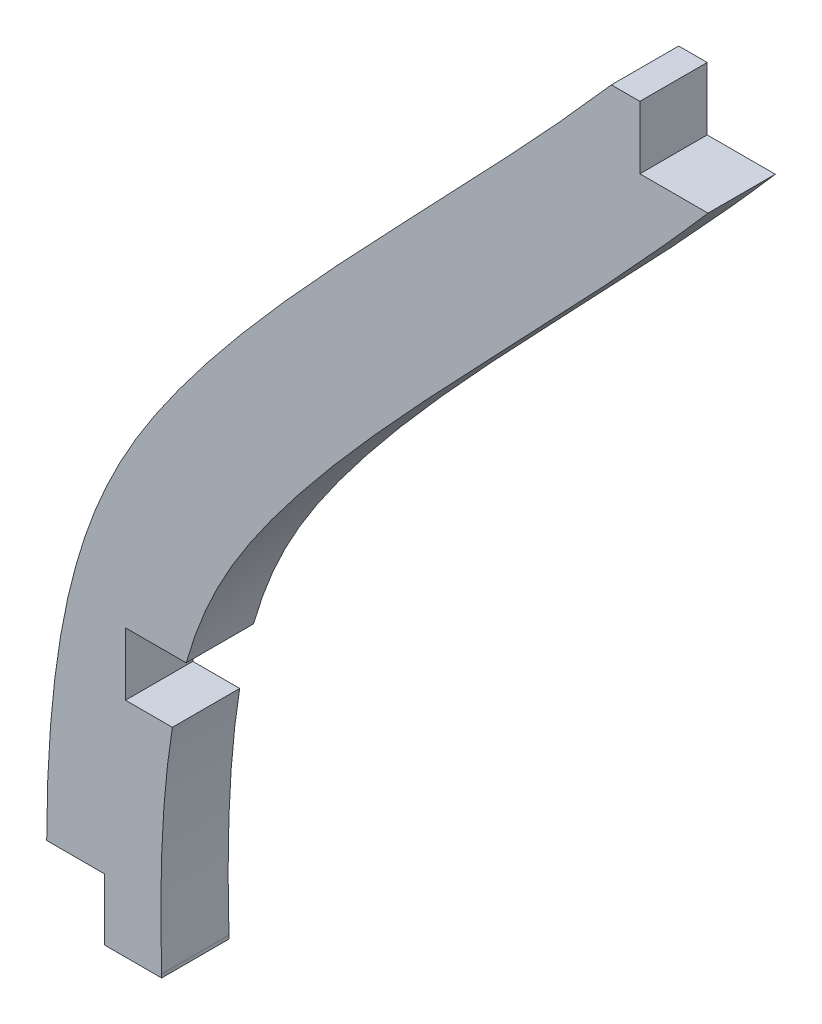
ISO-10303-21;
HEADER;
FILE_DESCRIPTION(('STEP AP214'),'2;1');
FILE_NAME('part.step','',(''),(''),'','','');
FILE_SCHEMA(('AUTOMOTIVE_DESIGN { 1 0 10303 214 1 1 1 1 }'));
ENDSEC;
DATA;
#1=APPLICATION_CONTEXT('core data for automotive mechanical design processes');
#2=APPLICATION_PROTOCOL_DEFINITION('international standard','automotive_design',2000,#1);
#3=PRODUCT_CONTEXT('',#1,'mechanical');
#4=PRODUCT('Part','Part','',(#3));
#5=PRODUCT_RELATED_PRODUCT_CATEGORY('part','',(#4));
#6=PRODUCT_DEFINITION_FORMATION('','',#4);
#7=PRODUCT_DEFINITION_CONTEXT('part definition',#1,'design');
#8=PRODUCT_DEFINITION('design','',#6,#7);
#9=PRODUCT_DEFINITION_SHAPE('','',#8);
#10=(LENGTH_UNIT() NAMED_UNIT(*) SI_UNIT(.MILLI.,.METRE.));
#11=(NAMED_UNIT(*) PLANE_ANGLE_UNIT() SI_UNIT($,.RADIAN.));
#12=(NAMED_UNIT(*) SI_UNIT($,.STERADIAN.) SOLID_ANGLE_UNIT());
#13=UNCERTAINTY_MEASURE_WITH_UNIT(LENGTH_MEASURE(1.E-05),#10,'distance_accuracy_value','');
#14=(GEOMETRIC_REPRESENTATION_CONTEXT(3) GLOBAL_UNCERTAINTY_ASSIGNED_CONTEXT((#13)) GLOBAL_UNIT_ASSIGNED_CONTEXT((#10,
#11,#12)) REPRESENTATION_CONTEXT('',''));
#15=CARTESIAN_POINT('',(0.,0.,0.));
#16=DIRECTION('',(0.,0.,1.));
#17=DIRECTION('',(1.,0.,0.));
#18=AXIS2_PLACEMENT_3D('',#15,#16,#17);
#19=CARTESIAN_POINT('',(-71.12228275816,0.152274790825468,2.9972));
#20=CARTESIAN_POINT('',(-71.1360709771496,0.612053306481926,2.9972));
#21=CARTESIAN_POINT('',(-71.1567058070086,1.54979316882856,2.9972));
#22=CARTESIAN_POINT('',(-71.1645984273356,3.28211812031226,2.9972));
#23=CARTESIAN_POINT('',(-71.1167972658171,5.2861742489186,2.9972));
#24=CARTESIAN_POINT('',(-70.9730711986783,7.42161548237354,2.9972));
#25=CARTESIAN_POINT('',(-70.6767068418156,9.95097976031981,2.9972));
#26=CARTESIAN_POINT('',(-70.1305550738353,12.5718264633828,2.9972));
#27=CARTESIAN_POINT('',(-69.2453812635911,15.104636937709,2.9972));
#28=CARTESIAN_POINT('',(-68.1202374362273,17.3343932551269,2.9972));
#29=CARTESIAN_POINT('',(-66.672184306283,19.5510756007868,2.9972));
#30=CARTESIAN_POINT('',(-64.8630643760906,21.9349302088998,2.9972));
#31=CARTESIAN_POINT('',(-62.1184326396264,25.2082421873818,2.9972));
#32=CARTESIAN_POINT('',(-58.1371910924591,29.5028468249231,2.9972));
#33=CARTESIAN_POINT('',(-52.8597313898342,34.9642275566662,2.9972));
#34=CARTESIAN_POINT('',(-47.4482093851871,40.7915416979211,2.9972));
#35=CARTESIAN_POINT('',(-42.2515146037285,47.0604507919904,2.9972));
#36=CARTESIAN_POINT('',(-37.6918324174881,53.925317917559,2.9972));
#37=CARTESIAN_POINT('',(-34.0642333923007,61.0843459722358,2.9972));
#38=CARTESIAN_POINT('',(-31.169794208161,68.4657942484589,2.9972));
#39=CARTESIAN_POINT('',(-28.9001236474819,75.9824768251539,2.9972));
#40=CARTESIAN_POINT('',(-27.1227122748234,83.5631378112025,2.9972));
#41=CARTESIAN_POINT('',(-25.7154204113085,91.1411224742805,2.9972));
#42=CARTESIAN_POINT('',(-24.7522109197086,97.3940158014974,2.9972));
#43=CARTESIAN_POINT('',(-24.0485885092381,102.335722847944,2.9972));
#44=CARTESIAN_POINT('',(-23.7122461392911,104.762949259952,2.9972));
#45=CARTESIAN_POINT('',(-23.5431598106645,105.98215738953,2.9972));
#46=B_SPLINE_CURVE_WITH_KNOTS('',3,(#19,#20,#21,#22,#23,#24,#25,#26,#27,#28,#29,#30,#31,#32,#33,
#34,#35,#36,#37,#38,#39,#40,#41,#42,#43,#44,#45),.UNSPECIFIED.,.F.,.F.,(4,1,1,1,1,1,1,1,1,1,1,1,
1,1,1,1,1,1,1,1,1,1,1,1,4),(0.,0.0078125,0.015625,0.03125,0.046875,0.0625,0.09375,0.125,0.15625,
0.1875,0.21875,0.25,0.3125,0.375,0.4375,0.5,0.5625,0.625,0.6875,0.75,0.8125,0.875,0.9375,
0.96875,1.),.UNSPECIFIED.);
#47=DIRECTION('',(0.,0.,-1.));
#48=VECTOR('',#47,1.);
#49=SURFACE_OF_LINEAR_EXTRUSION('',#46,#48);
#50=CARTESIAN_POINT('',(-71.12228275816,0.152274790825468,0.));
#51=CARTESIAN_POINT('',(-71.1360709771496,0.612053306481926,0.));
#52=CARTESIAN_POINT('',(-71.1567058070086,1.54979316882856,0.));
#53=CARTESIAN_POINT('',(-71.1645984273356,3.28211812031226,0.));
#54=CARTESIAN_POINT('',(-71.1167972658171,5.2861742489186,0.));
#55=CARTESIAN_POINT('',(-70.9730711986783,7.42161548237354,0.));
#56=CARTESIAN_POINT('',(-70.6767068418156,9.95097976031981,0.));
#57=CARTESIAN_POINT('',(-70.1305550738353,12.5718264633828,0.));
#58=CARTESIAN_POINT('',(-69.2453812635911,15.104636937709,0.));
#59=CARTESIAN_POINT('',(-68.1202374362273,17.3343932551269,0.));
#60=CARTESIAN_POINT('',(-66.672184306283,19.5510756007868,0.));
#61=CARTESIAN_POINT('',(-64.8630643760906,21.9349302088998,0.));
#62=CARTESIAN_POINT('',(-62.1184326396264,25.2082421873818,0.));
#63=CARTESIAN_POINT('',(-58.1371910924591,29.5028468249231,0.));
#64=CARTESIAN_POINT('',(-52.8597313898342,34.9642275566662,0.));
#65=CARTESIAN_POINT('',(-47.4482093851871,40.7915416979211,0.));
#66=CARTESIAN_POINT('',(-42.2515146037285,47.0604507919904,0.));
#67=CARTESIAN_POINT('',(-37.6918324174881,53.925317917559,0.));
#68=CARTESIAN_POINT('',(-34.0642333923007,61.0843459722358,0.));
#69=CARTESIAN_POINT('',(-31.169794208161,68.4657942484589,0.));
#70=CARTESIAN_POINT('',(-28.9001236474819,75.9824768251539,0.));
#71=CARTESIAN_POINT('',(-27.1227122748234,83.5631378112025,0.));
#72=CARTESIAN_POINT('',(-25.7154204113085,91.1411224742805,0.));
#73=CARTESIAN_POINT('',(-24.7522109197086,97.3940158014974,0.));
#74=CARTESIAN_POINT('',(-24.0485885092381,102.335722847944,0.));
#75=CARTESIAN_POINT('',(-23.7122461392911,104.762949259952,0.));
#76=CARTESIAN_POINT('',(-23.5431598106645,105.98215738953,0.));
#77=B_SPLINE_CURVE_WITH_KNOTS('',3,(#50,#51,#52,#53,#54,#55,#56,#57,#58,#59,#60,#61,#62,#63,#64,
#65,#66,#67,#68,#69,#70,#71,#72,#73,#74,#75,#76),.UNSPECIFIED.,.F.,.F.,(4,1,1,1,1,1,1,1,1,1,1,1,
1,1,1,1,1,1,1,1,1,1,1,1,4),(0.,0.0078125,0.015625,0.03125,0.046875,0.0625,0.09375,0.125,0.15625,
0.1875,0.21875,0.25,0.3125,0.375,0.4375,0.5,0.5625,0.625,0.6875,0.75,0.8125,0.875,0.9375,
0.96875,1.),.UNSPECIFIED.);
#78=CARTESIAN_POINT('',(-70.0284766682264,12.7,0.));
#79=VERTEX_POINT('',#78);
#80=CARTESIAN_POINT('',(-46.7957446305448,41.656,0.));
#81=VERTEX_POINT('',#80);
#82=EDGE_CURVE('E157',#79,#81,#77,.T.);
#83=ORIENTED_EDGE('',*,*,#82,.T.);
#84=DIRECTION('',(0.,0.,-1.));
#85=VECTOR('',#84,1.);
#86=CARTESIAN_POINT('',(-46.7957446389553,41.656,2.9972));
#87=LINE('',#86,#85);
#88=CARTESIAN_POINT('',(-46.7957446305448,41.656,2.9972));
#89=VERTEX_POINT('',#88);
#90=EDGE_CURVE('E241',#81,#89,#87,.F.);
#91=ORIENTED_EDGE('',*,*,#90,.T.);
#92=CARTESIAN_POINT('',(-70.0284766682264,12.7,2.9972));
#93=VERTEX_POINT('',#92);
#94=EDGE_CURVE('E170',#93,#89,#46,.T.);
#95=ORIENTED_EDGE('',*,*,#94,.F.);
#96=DIRECTION('',(0.,0.,1.));
#97=VECTOR('',#96,1.);
#98=CARTESIAN_POINT('',(-70.0284766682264,12.7,0.));
#99=LINE('',#98,#97);
#100=EDGE_CURVE('E226',#79,#93,#99,.T.);
#101=ORIENTED_EDGE('',*,*,#100,.F.);
#102=EDGE_LOOP('',(#83,#91,#95,#101));
#103=FACE_BOUND('',#102,.T.);
#104=ADVANCED_FACE('F33',(#103),#49,.F.);
#105=CARTESIAN_POINT('',(-71.12228275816,0.152274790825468,0.));
#106=VERTEX_POINT('',#105);
#107=CARTESIAN_POINT('',(-70.6430311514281,9.90599999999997,0.));
#108=VERTEX_POINT('',#107);
#109=EDGE_CURVE('E153',#106,#108,#77,.T.);
#110=ORIENTED_EDGE('',*,*,#109,.T.);
#111=DIRECTION('',(0.,0.,1.));
#112=VECTOR('',#111,1.);
#113=CARTESIAN_POINT('',(-70.6430311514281,9.90599999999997,0.));
#114=LINE('',#113,#112);
#115=CARTESIAN_POINT('',(-70.6430311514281,9.90599999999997,2.9972));
#116=VERTEX_POINT('',#115);
#117=EDGE_CURVE('E212',#108,#116,#114,.T.);
#118=ORIENTED_EDGE('',*,*,#117,.T.);
#119=CARTESIAN_POINT('',(-71.12228275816,0.152274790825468,2.9972));
#120=VERTEX_POINT('',#119);
#121=EDGE_CURVE('E171',#120,#116,#46,.T.);
#122=ORIENTED_EDGE('',*,*,#121,.F.);
#123=DIRECTION('',(0.,0.,-1.));
#124=VECTOR('',#123,1.);
#125=CARTESIAN_POINT('',(-71.12228275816,0.152274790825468,2.9972));
#126=LINE('',#125,#124);
#127=EDGE_CURVE('E42',#120,#106,#126,.T.);
#128=ORIENTED_EDGE('',*,*,#127,.T.);
#129=EDGE_LOOP('',(#110,#118,#122,#128));
#130=FACE_BOUND('',#129,.T.);
#131=ADVANCED_FACE('F188',(#130),#49,.F.);
#132=CARTESIAN_POINT('',(-28.575,106.68,2.9972));
#133=CARTESIAN_POINT('',(-31.1223322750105,88.3122925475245,2.9972));
#134=CARTESIAN_POINT('',(-35.6949869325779,54.9592886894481,2.9972));
#135=CARTESIAN_POINT('',(-70.4253531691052,26.7634785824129,2.9972));
#136=CARTESIAN_POINT('',(-76.5696549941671,12.326423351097,2.9972));
#137=CARTESIAN_POINT('',(-76.2,0.,2.9972));
#138=B_SPLINE_CURVE_WITH_KNOTS('',3,(#132,#133,#134,#135,#136,#137),.UNSPECIFIED.,.F.,.F.,(4,1,
1,4),(0.,0.473853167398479,0.807071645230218,1.),.UNSPECIFIED.);
#139=DIRECTION('',(0.,0.,-1.));
#140=VECTOR('',#139,1.);
#141=SURFACE_OF_LINEAR_EXTRUSION('',#138,#140);
#142=CARTESIAN_POINT('',(-51.097631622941,44.45,2.9972));
#143=VERTEX_POINT('',#142);
#144=CARTESIAN_POINT('',(-76.239147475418,2.74319999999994,2.9972));
#145=VERTEX_POINT('',#144);
#146=EDGE_CURVE('E145',#143,#145,#138,.T.);
#147=ORIENTED_EDGE('',*,*,#146,.F.);
#148=DIRECTION('',(0.,0.,-1.));
#149=VECTOR('',#148,1.);
#150=CARTESIAN_POINT('',(-51.0976316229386,44.45,2.9972));
#151=LINE('',#150,#149);
#152=CARTESIAN_POINT('',(-51.097631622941,44.45,0.));
#153=VERTEX_POINT('',#152);
#154=EDGE_CURVE('E129',#143,#153,#151,.T.);
#155=ORIENTED_EDGE('',*,*,#154,.T.);
#156=CARTESIAN_POINT('',(-28.575,106.68,0.));
#157=CARTESIAN_POINT('',(-31.1223322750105,88.3122925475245,0.));
#158=CARTESIAN_POINT('',(-35.6949869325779,54.9592886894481,0.));
#159=CARTESIAN_POINT('',(-70.4253531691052,26.7634785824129,0.));
#160=CARTESIAN_POINT('',(-76.5696549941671,12.326423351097,0.));
#161=CARTESIAN_POINT('',(-76.2,0.,0.));
#162=B_SPLINE_CURVE_WITH_KNOTS('',3,(#156,#157,#158,#159,#160,#161),.UNSPECIFIED.,.F.,.F.,(4,1,
1,4),(0.,0.473853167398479,0.807071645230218,1.),.UNSPECIFIED.);
#163=CARTESIAN_POINT('',(-76.239147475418,2.74319999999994,0.));
#164=VERTEX_POINT('',#163);
#165=EDGE_CURVE('E177',#153,#164,#162,.T.);
#166=ORIENTED_EDGE('',*,*,#165,.T.);
#167=DIRECTION('',(0.,0.,1.));
#168=VECTOR('',#167,1.);
#169=CARTESIAN_POINT('',(-76.239147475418,2.74319999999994,0.));
#170=LINE('',#169,#168);
#171=EDGE_CURVE('E151',#164,#145,#170,.T.);
#172=ORIENTED_EDGE('',*,*,#171,.T.);
#173=EDGE_LOOP('',(#147,#155,#166,#172));
#174=FACE_BOUND('',#173,.T.);
#175=ADVANCED_FACE('F35',(#174),#141,.F.);
#176=CARTESIAN_POINT('',(-71.1222823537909,0.,2.9972));
#177=DIRECTION('',(0.,1.,0.));
#178=DIRECTION('',(-1.,0.,0.));
#179=AXIS2_PLACEMENT_3D('',#176,#177,#178);
#180=PLANE('',#179);
#181=DIRECTION('',(1.,0.,0.));
#182=VECTOR('',#181,1.);
#183=CARTESIAN_POINT('',(-71.1222823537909,0.,2.9972));
#184=LINE('',#183,#182);
#185=CARTESIAN_POINT('',(-73.66,0.,2.9972));
#186=VERTEX_POINT('',#185);
#187=CARTESIAN_POINT('',(-71.1222823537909,0.,2.9972));
#188=VERTEX_POINT('',#187);
#189=EDGE_CURVE('E152',#186,#188,#184,.T.);
#190=ORIENTED_EDGE('',*,*,#189,.F.);
#191=DIRECTION('',(0.,0.,1.));
#192=VECTOR('',#191,1.);
#193=CARTESIAN_POINT('',(-73.66,0.,0.));
#194=LINE('',#193,#192);
#195=CARTESIAN_POINT('',(-73.66,0.,0.));
#196=VERTEX_POINT('',#195);
#197=EDGE_CURVE('E163',#196,#186,#194,.T.);
#198=ORIENTED_EDGE('',*,*,#197,.F.);
#199=DIRECTION('',(1.,0.,0.));
#200=VECTOR('',#199,1.);
#201=CARTESIAN_POINT('',(-71.1222823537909,0.,0.));
#202=LINE('',#201,#200);
#203=CARTESIAN_POINT('',(-71.1222823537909,0.,0.));
#204=VERTEX_POINT('',#203);
#205=EDGE_CURVE('E274',#196,#204,#202,.T.);
#206=ORIENTED_EDGE('',*,*,#205,.T.);
#207=DIRECTION('',(0.,0.,-1.));
#208=VECTOR('',#207,1.);
#209=CARTESIAN_POINT('',(-71.1222823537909,0.,2.9972));
#210=LINE('',#209,#208);
#211=EDGE_CURVE('E11',#188,#204,#210,.T.);
#212=ORIENTED_EDGE('',*,*,#211,.F.);
#213=EDGE_LOOP('',(#190,#198,#206,#212));
#214=FACE_BOUND('',#213,.T.);
#215=ADVANCED_FACE('F194',(#214),#180,.F.);
#216=CARTESIAN_POINT('',(-71.12228275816,0.152274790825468,2.9972));
#217=DIRECTION('',(-0.999999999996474,-2.65552242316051E-06,0.));
#218=DIRECTION('',(2.65552242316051E-06,-0.999999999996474,0.));
#219=AXIS2_PLACEMENT_3D('',#216,#217,#218);
#220=PLANE('',#219);
#221=DIRECTION('',(-2.65552242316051E-06,0.999999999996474,0.));
#222=VECTOR('',#221,1.);
#223=CARTESIAN_POINT('',(-71.12228275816,0.152274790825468,0.));
#224=LINE('',#223,#222);
#225=EDGE_CURVE('E273',#204,#106,#224,.T.);
#226=ORIENTED_EDGE('',*,*,#225,.T.);
#227=ORIENTED_EDGE('',*,*,#127,.F.);
#228=DIRECTION('',(-2.65552242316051E-06,0.999999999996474,0.));
#229=VECTOR('',#228,1.);
#230=CARTESIAN_POINT('',(-71.12228275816,0.152274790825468,2.9972));
#231=LINE('',#230,#229);
#232=EDGE_CURVE('E154',#188,#120,#231,.T.);
#233=ORIENTED_EDGE('',*,*,#232,.F.);
#234=ORIENTED_EDGE('',*,*,#211,.T.);
#235=EDGE_LOOP('',(#226,#227,#233,#234));
#236=FACE_BOUND('',#235,.T.);
#237=ADVANCED_FACE('F192',(#236),#220,.F.);
#238=CARTESIAN_POINT('',(-46.430466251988,50.1960313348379,2.9972));
#239=DIRECTION('',(0.,0.,1.));
#240=DIRECTION('',(1.,0.,0.));
#241=AXIS2_PLACEMENT_3D('',#238,#239,#240);
#242=PLANE('',#241);
#243=DIRECTION('',(1.,0.,0.));
#244=VECTOR('',#243,1.);
#245=CARTESIAN_POINT('',(-52.1715847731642,44.45,2.9972));
#246=LINE('',#245,#244);
#247=CARTESIAN_POINT('',(-49.8276316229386,44.45,2.9972));
#248=VERTEX_POINT('',#247);
#249=EDGE_CURVE('E132',#143,#248,#246,.T.);
#250=ORIENTED_EDGE('',*,*,#249,.F.);
#251=ORIENTED_EDGE('',*,*,#146,.T.);
#252=DIRECTION('',(-1.,0.,0.));
#253=VECTOR('',#252,1.);
#254=CARTESIAN_POINT('',(-73.66,2.7432,2.9972));
#255=LINE('',#254,#253);
#256=CARTESIAN_POINT('',(-73.66,2.7432,2.9972));
#257=VERTEX_POINT('',#256);
#258=EDGE_CURVE('E210',#257,#145,#255,.T.);
#259=ORIENTED_EDGE('',*,*,#258,.F.);
#260=DIRECTION('',(0.,1.,0.));
#261=VECTOR('',#260,1.);
#262=CARTESIAN_POINT('',(-73.66,0.,2.9972));
#263=LINE('',#262,#261);
#264=EDGE_CURVE('E209',#186,#257,#263,.T.);
#265=ORIENTED_EDGE('',*,*,#264,.F.);
#266=ORIENTED_EDGE('',*,*,#189,.T.);
#267=ORIENTED_EDGE('',*,*,#232,.T.);
#268=ORIENTED_EDGE('',*,*,#121,.T.);
#269=DIRECTION('',(1.,0.,0.));
#270=VECTOR('',#269,1.);
#271=CARTESIAN_POINT('',(-72.7299662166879,9.906,2.9972));
#272=LINE('',#271,#270);
#273=CARTESIAN_POINT('',(-72.7299662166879,9.906,2.9972));
#274=VERTEX_POINT('',#273);
#275=EDGE_CURVE('E232',#274,#116,#272,.T.);
#276=ORIENTED_EDGE('',*,*,#275,.F.);
#277=DIRECTION('',(0.,-1.,0.));
#278=VECTOR('',#277,1.);
#279=CARTESIAN_POINT('',(-72.7299662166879,12.7,2.9972));
#280=LINE('',#279,#278);
#281=CARTESIAN_POINT('',(-72.7299662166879,12.7,2.9972));
#282=VERTEX_POINT('',#281);
#283=EDGE_CURVE('E235',#282,#274,#280,.T.);
#284=ORIENTED_EDGE('',*,*,#283,.F.);
#285=DIRECTION('',(-1.,0.,0.));
#286=VECTOR('',#285,1.);
#287=CARTESIAN_POINT('',(-70.0284766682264,12.7,2.9972));
#288=LINE('',#287,#286);
#289=EDGE_CURVE('E238',#93,#282,#288,.T.);
#290=ORIENTED_EDGE('',*,*,#289,.F.);
#291=ORIENTED_EDGE('',*,*,#94,.T.);
#292=DIRECTION('',(1.,0.,0.));
#293=VECTOR('',#292,1.);
#294=CARTESIAN_POINT('',(-44.459383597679,41.656,2.9972));
#295=LINE('',#294,#293);
#296=CARTESIAN_POINT('',(-49.8276316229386,41.656,2.9972));
#297=VERTEX_POINT('',#296);
#298=EDGE_CURVE('E254',#297,#89,#295,.T.);
#299=ORIENTED_EDGE('',*,*,#298,.F.);
#300=DIRECTION('',(0.,-1.,0.));
#301=VECTOR('',#300,1.);
#302=CARTESIAN_POINT('',(-49.8276316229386,41.656,2.9972));
#303=LINE('',#302,#301);
#304=EDGE_CURVE('E139',#248,#297,#303,.T.);
#305=ORIENTED_EDGE('',*,*,#304,.F.);
#306=EDGE_LOOP('',(#250,#251,#259,#265,#266,#267,#268,#276,#284,#290,#291,#299,#305));
#307=FACE_BOUND('',#306,.T.);
#308=ADVANCED_FACE('F143',(#307),#242,.T.);
#309=CARTESIAN_POINT('',(-46.430466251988,50.1960313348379,0.));
#310=DIRECTION('',(0.,0.,1.));
#311=DIRECTION('',(1.,0.,0.));
#312=AXIS2_PLACEMENT_3D('',#309,#310,#311);
#313=PLANE('',#312);
#314=ORIENTED_EDGE('',*,*,#165,.F.);
#315=DIRECTION('',(1.,0.,0.));
#316=VECTOR('',#315,1.);
#317=CARTESIAN_POINT('',(-46.430466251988,44.45,0.));
#318=LINE('',#317,#316);
#319=CARTESIAN_POINT('',(-49.8276316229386,44.45,0.));
#320=VERTEX_POINT('',#319);
#321=EDGE_CURVE('E135',#153,#320,#318,.T.);
#322=ORIENTED_EDGE('',*,*,#321,.T.);
#323=DIRECTION('',(0.,-1.,0.));
#324=VECTOR('',#323,1.);
#325=CARTESIAN_POINT('',(-49.8276316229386,41.656,0.));
#326=LINE('',#325,#324);
#327=CARTESIAN_POINT('',(-49.8276316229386,41.656,0.));
#328=VERTEX_POINT('',#327);
#329=EDGE_CURVE('E256',#320,#328,#326,.T.);
#330=ORIENTED_EDGE('',*,*,#329,.T.);
#331=DIRECTION('',(1.,0.,0.));
#332=VECTOR('',#331,1.);
#333=CARTESIAN_POINT('',(-44.459383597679,41.656,0.));
#334=LINE('',#333,#332);
#335=EDGE_CURVE('E252',#328,#81,#334,.T.);
#336=ORIENTED_EDGE('',*,*,#335,.T.);
#337=ORIENTED_EDGE('',*,*,#82,.F.);
#338=DIRECTION('',(-1.,0.,0.));
#339=VECTOR('',#338,1.);
#340=CARTESIAN_POINT('',(-70.0284766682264,12.7,0.));
#341=LINE('',#340,#339);
#342=CARTESIAN_POINT('',(-72.7299662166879,12.7,0.));
#343=VERTEX_POINT('',#342);
#344=EDGE_CURVE('E234',#79,#343,#341,.T.);
#345=ORIENTED_EDGE('',*,*,#344,.T.);
#346=DIRECTION('',(0.,-1.,0.));
#347=VECTOR('',#346,1.);
#348=CARTESIAN_POINT('',(-72.7299662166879,12.7,0.));
#349=LINE('',#348,#347);
#350=CARTESIAN_POINT('',(-72.7299662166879,9.906,0.));
#351=VERTEX_POINT('',#350);
#352=EDGE_CURVE('E49',#343,#351,#349,.T.);
#353=ORIENTED_EDGE('',*,*,#352,.T.);
#354=DIRECTION('',(1.,0.,0.));
#355=VECTOR('',#354,1.);
#356=CARTESIAN_POINT('',(-72.7299662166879,9.906,0.));
#357=LINE('',#356,#355);
#358=EDGE_CURVE('E229',#351,#108,#357,.T.);
#359=ORIENTED_EDGE('',*,*,#358,.T.);
#360=ORIENTED_EDGE('',*,*,#109,.F.);
#361=ORIENTED_EDGE('',*,*,#225,.F.);
#362=ORIENTED_EDGE('',*,*,#205,.F.);
#363=DIRECTION('',(0.,1.,0.));
#364=VECTOR('',#363,1.);
#365=CARTESIAN_POINT('',(-73.66,0.,0.));
#366=LINE('',#365,#364);
#367=CARTESIAN_POINT('',(-73.66,2.7432,0.));
#368=VERTEX_POINT('',#367);
#369=EDGE_CURVE('E214',#196,#368,#366,.T.);
#370=ORIENTED_EDGE('',*,*,#369,.T.);
#371=DIRECTION('',(-1.,0.,0.));
#372=VECTOR('',#371,1.);
#373=CARTESIAN_POINT('',(-73.66,2.7432,0.));
#374=LINE('',#373,#372);
#375=EDGE_CURVE('E57',#368,#164,#374,.T.);
#376=ORIENTED_EDGE('',*,*,#375,.T.);
#377=EDGE_LOOP('',(#314,#322,#330,#336,#337,#345,#353,#359,#360,#361,#362,#370,#376));
#378=FACE_BOUND('',#377,.T.);
#379=ADVANCED_FACE('F190',(#378),#313,.F.);
#380=CARTESIAN_POINT('',(-73.66,2.7432,0.));
#381=DIRECTION('',(0.,1.,0.));
#382=DIRECTION('',(-1.,0.,0.));
#383=AXIS2_PLACEMENT_3D('',#380,#381,#382);
#384=PLANE('',#383);
#385=ORIENTED_EDGE('',*,*,#258,.T.);
#386=ORIENTED_EDGE('',*,*,#171,.F.);
#387=ORIENTED_EDGE('',*,*,#375,.F.);
#388=DIRECTION('',(0.,0.,1.));
#389=VECTOR('',#388,1.);
#390=CARTESIAN_POINT('',(-73.66,2.7432,0.));
#391=LINE('',#390,#389);
#392=EDGE_CURVE('E222',#368,#257,#391,.T.);
#393=ORIENTED_EDGE('',*,*,#392,.T.);
#394=EDGE_LOOP('',(#385,#386,#387,#393));
#395=FACE_BOUND('',#394,.T.);
#396=ADVANCED_FACE('F305',(#395),#384,.F.);
#397=CARTESIAN_POINT('',(-73.66,0.,0.));
#398=DIRECTION('',(1.,0.,0.));
#399=DIRECTION('',(0.,0.,-1.));
#400=AXIS2_PLACEMENT_3D('',#397,#398,#399);
#401=PLANE('',#400);
#402=ORIENTED_EDGE('',*,*,#264,.T.);
#403=ORIENTED_EDGE('',*,*,#392,.F.);
#404=ORIENTED_EDGE('',*,*,#369,.F.);
#405=ORIENTED_EDGE('',*,*,#197,.T.);
#406=EDGE_LOOP('',(#402,#403,#404,#405));
#407=FACE_BOUND('',#406,.T.);
#408=ADVANCED_FACE('F308',(#407),#401,.F.);
#409=CARTESIAN_POINT('',(-72.7299662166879,9.906,0.));
#410=DIRECTION('',(0.,-1.,0.));
#411=DIRECTION('',(1.,0.,0.));
#412=AXIS2_PLACEMENT_3D('',#409,#410,#411);
#413=PLANE('',#412);
#414=ORIENTED_EDGE('',*,*,#275,.T.);
#415=ORIENTED_EDGE('',*,*,#117,.F.);
#416=ORIENTED_EDGE('',*,*,#358,.F.);
#417=DIRECTION('',(0.,0.,1.));
#418=VECTOR('',#417,1.);
#419=CARTESIAN_POINT('',(-72.7299662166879,9.906,0.));
#420=LINE('',#419,#418);
#421=EDGE_CURVE('E217',#351,#274,#420,.T.);
#422=ORIENTED_EDGE('',*,*,#421,.T.);
#423=EDGE_LOOP('',(#414,#415,#416,#422));
#424=FACE_BOUND('',#423,.T.);
#425=ADVANCED_FACE('F288',(#424),#413,.F.);
#426=CARTESIAN_POINT('',(-72.7299662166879,12.7,0.));
#427=DIRECTION('',(-1.,0.,0.));
#428=DIRECTION('',(0.,0.,1.));
#429=AXIS2_PLACEMENT_3D('',#426,#427,#428);
#430=PLANE('',#429);
#431=ORIENTED_EDGE('',*,*,#283,.T.);
#432=ORIENTED_EDGE('',*,*,#421,.F.);
#433=ORIENTED_EDGE('',*,*,#352,.F.);
#434=DIRECTION('',(0.,0.,1.));
#435=VECTOR('',#434,1.);
#436=CARTESIAN_POINT('',(-72.7299662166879,12.7,0.));
#437=LINE('',#436,#435);
#438=EDGE_CURVE('E228',#343,#282,#437,.T.);
#439=ORIENTED_EDGE('',*,*,#438,.T.);
#440=EDGE_LOOP('',(#431,#432,#433,#439));
#441=FACE_BOUND('',#440,.T.);
#442=ADVANCED_FACE('F292',(#441),#430,.F.);
#443=CARTESIAN_POINT('',(-70.0284766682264,12.7,0.));
#444=DIRECTION('',(0.,1.,0.));
#445=DIRECTION('',(0.,0.,1.));
#446=AXIS2_PLACEMENT_3D('',#443,#444,#445);
#447=PLANE('',#446);
#448=ORIENTED_EDGE('',*,*,#289,.T.);
#449=ORIENTED_EDGE('',*,*,#438,.F.);
#450=ORIENTED_EDGE('',*,*,#344,.F.);
#451=ORIENTED_EDGE('',*,*,#100,.T.);
#452=EDGE_LOOP('',(#448,#449,#450,#451));
#453=FACE_BOUND('',#452,.T.);
#454=ADVANCED_FACE('F294',(#453),#447,.F.);
#455=CARTESIAN_POINT('',(-44.459383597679,41.656,0.));
#456=DIRECTION('',(0.,-1.,0.));
#457=DIRECTION('',(0.,0.,-1.));
#458=AXIS2_PLACEMENT_3D('',#455,#456,#457);
#459=PLANE('',#458);
#460=ORIENTED_EDGE('',*,*,#335,.F.);
#461=DIRECTION('',(0.,0.,1.));
#462=VECTOR('',#461,1.);
#463=CARTESIAN_POINT('',(-49.8276316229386,41.656,0.));
#464=LINE('',#463,#462);
#465=EDGE_CURVE('E249',#328,#297,#464,.T.);
#466=ORIENTED_EDGE('',*,*,#465,.T.);
#467=ORIENTED_EDGE('',*,*,#298,.T.);
#468=ORIENTED_EDGE('',*,*,#90,.F.);
#469=EDGE_LOOP('',(#460,#466,#467,#468));
#470=FACE_BOUND('',#469,.T.);
#471=ADVANCED_FACE('F267',(#470),#459,.F.);
#472=CARTESIAN_POINT('',(-49.8276316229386,41.656,0.));
#473=DIRECTION('',(-1.,0.,0.));
#474=DIRECTION('',(0.,0.,1.));
#475=AXIS2_PLACEMENT_3D('',#472,#473,#474);
#476=PLANE('',#475);
#477=ORIENTED_EDGE('',*,*,#304,.T.);
#478=ORIENTED_EDGE('',*,*,#465,.F.);
#479=ORIENTED_EDGE('',*,*,#329,.F.);
#480=DIRECTION('',(0.,0.,1.));
#481=VECTOR('',#480,1.);
#482=CARTESIAN_POINT('',(-49.8276316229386,44.45,0.));
#483=LINE('',#482,#481);
#484=EDGE_CURVE('E250',#320,#248,#483,.T.);
#485=ORIENTED_EDGE('',*,*,#484,.T.);
#486=EDGE_LOOP('',(#477,#478,#479,#485));
#487=FACE_BOUND('',#486,.T.);
#488=ADVANCED_FACE('F264',(#487),#476,.F.);
#489=CARTESIAN_POINT('',(-52.1715847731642,44.45,-4.6228));
#490=DIRECTION('',(0.,-1.,0.));
#491=DIRECTION('',(0.,0.,-1.));
#492=AXIS2_PLACEMENT_3D('',#489,#490,#491);
#493=PLANE('',#492);
#494=ORIENTED_EDGE('',*,*,#249,.T.);
#495=ORIENTED_EDGE('',*,*,#484,.F.);
#496=ORIENTED_EDGE('',*,*,#321,.F.);
#497=ORIENTED_EDGE('',*,*,#154,.F.);
#498=EDGE_LOOP('',(#494,#495,#496,#497));
#499=FACE_BOUND('',#498,.T.);
#500=ADVANCED_FACE('F131',(#499),#493,.F.);
#501=CLOSED_SHELL('',(#104,#131,#175,#215,#237,#308,#379,#396,#408,#425,#442,#454,#471,#488,#500));
#502=MANIFOLD_SOLID_BREP('B2',#501);
#503=ADVANCED_BREP_SHAPE_REPRESENTATION('',(#18,#502),#14);
#504=SHAPE_DEFINITION_REPRESENTATION(#9,#503);
ENDSEC;
END-ISO-10303-21;
